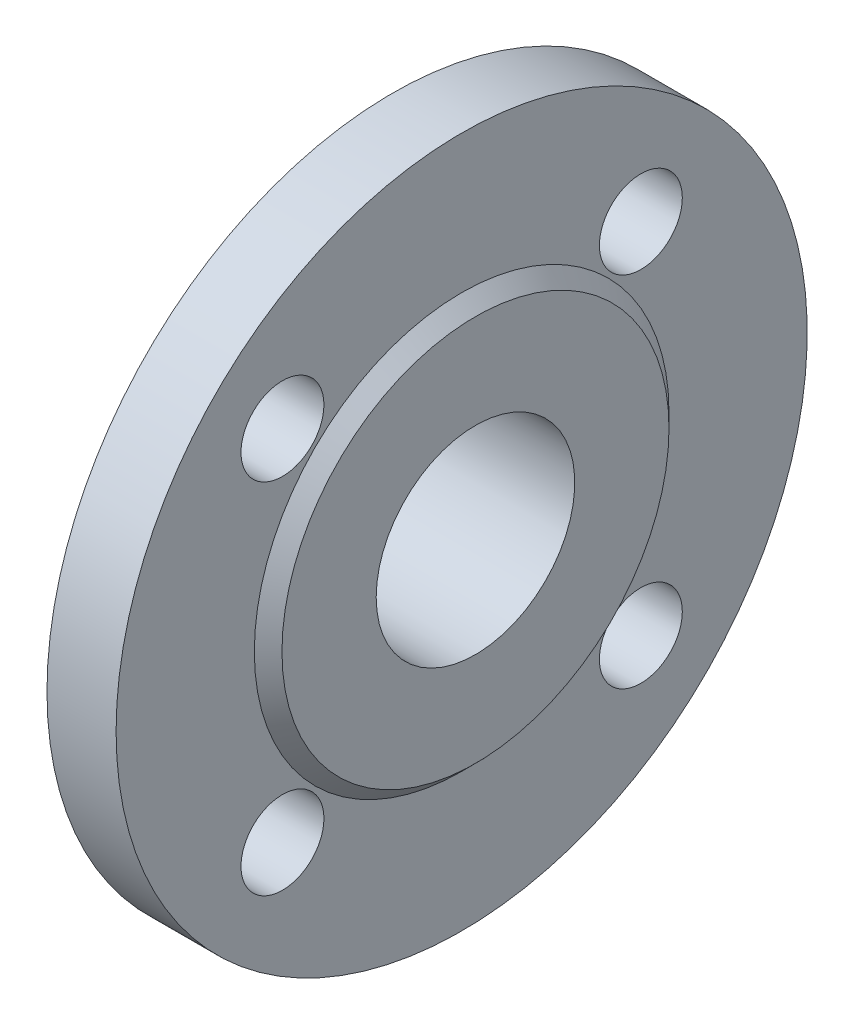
from build123d import *

# Parameters (mm, degrees)
ESQUISSE2_R      = 9
EXTRUSION1_DEPTH = 498.238373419


with BuildPart() as part:
    # Esquisse1 → R_volution1 (revolve)
    with BuildSketch(Plane.XY, mode=Mode.PRIVATE) as r_volution1_sk:
        Polygon((678, -390.85), (685, -390.85), (702, -383), (702, -340), (717, -340), (717, -370), (720, -373), (720, -393.45), (678, -393.45), align=None)
    revolve(r_volution1_sk.sketch.rotate(Axis((678, -415, 0), (1, 0, 0)), 90), axis=Axis((678, -415, 0), (1, 0, 0)))

    # Esquisse2 → Extrusion1 (cut, through all)
    with BuildSketch(Plane(origin=(717, 0, 0), x_dir=(0, 0, -1), z_dir=(1, 0, 0))):
        with Locations((38.890872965, -376.109127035)):
            Circle(ESQUISSE2_R)
        with Locations((38.890872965, -453.890872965)):
            Circle(ESQUISSE2_R)
        with Locations((-38.890872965, -453.890872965)):
            Circle(ESQUISSE2_R)
        with Locations((-38.890872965, -376.109127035)):
            Circle(ESQUISSE2_R)
    extrude(amount=-EXTRUSION1_DEPTH, mode=Mode.SUBTRACT)


solid = part.part
